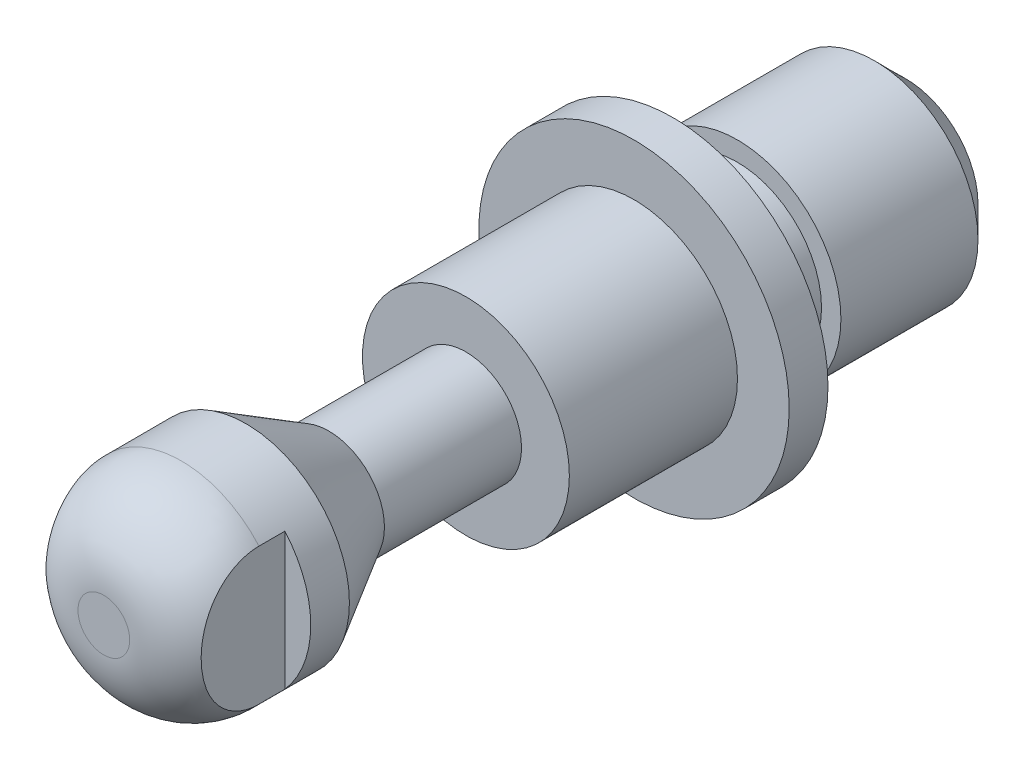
ISO-10303-21;
HEADER;
FILE_DESCRIPTION(('STEP AP214'),'2;1');
FILE_NAME('part.step','',(''),(''),'','','');
FILE_SCHEMA(('AUTOMOTIVE_DESIGN { 1 0 10303 214 1 1 1 1 }'));
ENDSEC;
DATA;
#1=APPLICATION_CONTEXT('core data for automotive mechanical design processes');
#2=APPLICATION_PROTOCOL_DEFINITION('international standard','automotive_design',2000,#1);
#3=PRODUCT_CONTEXT('',#1,'mechanical');
#4=PRODUCT('Part','Part','',(#3));
#5=PRODUCT_RELATED_PRODUCT_CATEGORY('part','',(#4));
#6=PRODUCT_DEFINITION_FORMATION('','',#4);
#7=PRODUCT_DEFINITION_CONTEXT('part definition',#1,'design');
#8=PRODUCT_DEFINITION('design','',#6,#7);
#9=PRODUCT_DEFINITION_SHAPE('','',#8);
#10=(LENGTH_UNIT() NAMED_UNIT(*) SI_UNIT(.MILLI.,.METRE.));
#11=(NAMED_UNIT(*) PLANE_ANGLE_UNIT() SI_UNIT($,.RADIAN.));
#12=(NAMED_UNIT(*) SI_UNIT($,.STERADIAN.) SOLID_ANGLE_UNIT());
#13=UNCERTAINTY_MEASURE_WITH_UNIT(LENGTH_MEASURE(1.E-05),#10,'distance_accuracy_value','');
#14=(GEOMETRIC_REPRESENTATION_CONTEXT(3) GLOBAL_UNCERTAINTY_ASSIGNED_CONTEXT((#13)) GLOBAL_UNIT_ASSIGNED_CONTEXT((#10,
#11,#12)) REPRESENTATION_CONTEXT('',''));
#15=CARTESIAN_POINT('',(0.,0.,0.));
#16=DIRECTION('',(0.,0.,1.));
#17=DIRECTION('',(1.,0.,0.));
#18=AXIS2_PLACEMENT_3D('',#15,#16,#17);
#19=CARTESIAN_POINT('',(0.,0.,0.));
#20=DIRECTION('',(0.,0.,-1.));
#21=DIRECTION('',(1.,0.,0.));
#22=AXIS2_PLACEMENT_3D('',#19,#20,#21);
#23=CYLINDRICAL_SURFACE('',#22,6.);
#24=CARTESIAN_POINT('',(0.,0.,0.));
#25=DIRECTION('',(0.,0.,-1.));
#26=DIRECTION('',(1.,0.,0.));
#27=AXIS2_PLACEMENT_3D('',#24,#25,#26);
#28=CIRCLE('',#27,6.);
#29=CARTESIAN_POINT('',(6.,0.,0.));
#30=VERTEX_POINT('',#29);
#31=EDGE_CURVE('E92',#30,#30,#28,.T.);
#32=ORIENTED_EDGE('',*,*,#31,.F.);
#33=EDGE_LOOP('',(#32));
#34=FACE_BOUND('',#33,.T.);
#35=CARTESIAN_POINT('',(0.,0.,1.5));
#36=DIRECTION('',(0.,0.,-1.));
#37=DIRECTION('',(1.,0.,0.));
#38=AXIS2_PLACEMENT_3D('',#35,#36,#37);
#39=CIRCLE('',#38,6.);
#40=CARTESIAN_POINT('',(6.,0.,1.5));
#41=VERTEX_POINT('',#40);
#42=EDGE_CURVE('E128',#41,#41,#39,.T.);
#43=ORIENTED_EDGE('',*,*,#42,.T.);
#44=EDGE_LOOP('',(#43));
#45=FACE_BOUND('',#44,.T.);
#46=ADVANCED_FACE('F15',(#34,#45),#23,.T.);
#47=CARTESIAN_POINT('',(0.,-6.,1.5));
#48=DIRECTION('',(0.,0.,-1.));
#49=DIRECTION('',(1.,0.,0.));
#50=AXIS2_PLACEMENT_3D('',#47,#48,#49);
#51=PLANE('',#50);
#52=ORIENTED_EDGE('',*,*,#42,.F.);
#53=EDGE_LOOP('',(#52));
#54=FACE_BOUND('',#53,.T.);
#55=CARTESIAN_POINT('',(0.,0.,1.5));
#56=DIRECTION('',(0.,0.,-1.));
#57=DIRECTION('',(1.,0.,0.));
#58=AXIS2_PLACEMENT_3D('',#55,#56,#57);
#59=CIRCLE('',#58,4.);
#60=CARTESIAN_POINT('',(4.,0.,1.5));
#61=VERTEX_POINT('',#60);
#62=EDGE_CURVE('E124',#61,#61,#59,.T.);
#63=ORIENTED_EDGE('',*,*,#62,.T.);
#64=EDGE_LOOP('',(#63));
#65=FACE_BOUND('',#64,.T.);
#66=ADVANCED_FACE('F181',(#54,#65),#51,.F.);
#67=CARTESIAN_POINT('',(0.,0.,0.));
#68=DIRECTION('',(0.,0.,-1.));
#69=DIRECTION('',(1.,0.,0.));
#70=AXIS2_PLACEMENT_3D('',#67,#68,#69);
#71=CYLINDRICAL_SURFACE('',#70,4.);
#72=ORIENTED_EDGE('',*,*,#62,.F.);
#73=EDGE_LOOP('',(#72));
#74=FACE_BOUND('',#73,.T.);
#75=CARTESIAN_POINT('',(0.,0.,8.));
#76=DIRECTION('',(0.,0.,-1.));
#77=DIRECTION('',(1.,0.,0.));
#78=AXIS2_PLACEMENT_3D('',#75,#76,#77);
#79=CIRCLE('',#78,4.);
#80=CARTESIAN_POINT('',(4.,0.,8.));
#81=VERTEX_POINT('',#80);
#82=EDGE_CURVE('E120',#81,#81,#79,.T.);
#83=ORIENTED_EDGE('',*,*,#82,.T.);
#84=EDGE_LOOP('',(#83));
#85=FACE_BOUND('',#84,.T.);
#86=ADVANCED_FACE('F187',(#74,#85),#71,.T.);
#87=CARTESIAN_POINT('',(0.,-2.15,8.));
#88=DIRECTION('',(0.,0.,-1.));
#89=DIRECTION('',(1.,0.,0.));
#90=AXIS2_PLACEMENT_3D('',#87,#88,#89);
#91=PLANE('',#90);
#92=ORIENTED_EDGE('',*,*,#82,.F.);
#93=EDGE_LOOP('',(#92));
#94=FACE_BOUND('',#93,.T.);
#95=CARTESIAN_POINT('',(0.,0.,8.));
#96=DIRECTION('',(0.,0.,-1.));
#97=DIRECTION('',(1.,0.,0.));
#98=AXIS2_PLACEMENT_3D('',#95,#96,#97);
#99=CIRCLE('',#98,2.15);
#100=CARTESIAN_POINT('',(2.15,0.,8.));
#101=VERTEX_POINT('',#100);
#102=EDGE_CURVE('E116',#101,#101,#99,.T.);
#103=ORIENTED_EDGE('',*,*,#102,.T.);
#104=EDGE_LOOP('',(#103));
#105=FACE_BOUND('',#104,.T.);
#106=ADVANCED_FACE('F195',(#94,#105),#91,.F.);
#107=CARTESIAN_POINT('',(0.,0.,0.));
#108=DIRECTION('',(0.,0.,-1.));
#109=DIRECTION('',(1.,0.,0.));
#110=AXIS2_PLACEMENT_3D('',#107,#108,#109);
#111=CYLINDRICAL_SURFACE('',#110,2.15);
#112=ORIENTED_EDGE('',*,*,#102,.F.);
#113=EDGE_LOOP('',(#112));
#114=FACE_BOUND('',#113,.T.);
#115=CARTESIAN_POINT('',(0.,0.,13.3));
#116=DIRECTION('',(0.,0.,-1.));
#117=DIRECTION('',(1.,0.,0.));
#118=AXIS2_PLACEMENT_3D('',#115,#116,#117);
#119=CIRCLE('',#118,2.15);
#120=CARTESIAN_POINT('',(2.15,0.,13.3));
#121=VERTEX_POINT('',#120);
#122=EDGE_CURVE('E112',#121,#121,#119,.T.);
#123=ORIENTED_EDGE('',*,*,#122,.T.);
#124=EDGE_LOOP('',(#123));
#125=FACE_BOUND('',#124,.T.);
#126=ADVANCED_FACE('F199',(#114,#125),#111,.T.);
#127=CARTESIAN_POINT('',(0.,0.,16.5042939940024));
#128=DIRECTION('',(0.,0.,1.));
#129=DIRECTION('',(-1.,0.,0.));
#130=AXIS2_PLACEMENT_3D('',#127,#128,#129);
#131=CONICAL_SURFACE('',#130,4.,0.523598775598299);
#132=ORIENTED_EDGE('',*,*,#122,.F.);
#133=EDGE_LOOP('',(#132));
#134=FACE_BOUND('',#133,.T.);
#135=CARTESIAN_POINT('',(0.,0.,16.5042939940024));
#136=DIRECTION('',(0.,0.,-1.));
#137=DIRECTION('',(1.,0.,0.));
#138=AXIS2_PLACEMENT_3D('',#135,#136,#137);
#139=CIRCLE('',#138,4.);
#140=CARTESIAN_POINT('',(4.,0.,16.5042939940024));
#141=VERTEX_POINT('',#140);
#142=EDGE_CURVE('E108',#141,#141,#139,.T.);
#143=ORIENTED_EDGE('',*,*,#142,.T.);
#144=EDGE_LOOP('',(#143));
#145=FACE_BOUND('',#144,.T.);
#146=ADVANCED_FACE('F203',(#134,#145),#131,.T.);
#147=CARTESIAN_POINT('',(0.,0.,0.));
#148=DIRECTION('',(0.,0.,-1.));
#149=DIRECTION('',(1.,0.,0.));
#150=AXIS2_PLACEMENT_3D('',#147,#148,#149);
#151=CYLINDRICAL_SURFACE('',#150,4.);
#152=CARTESIAN_POINT('',(0.,0.,19.));
#153=DIRECTION('',(0.,0.,-1.));
#154=DIRECTION('',(1.,0.,0.));
#155=AXIS2_PLACEMENT_3D('',#152,#153,#154);
#156=CIRCLE('',#155,4.);
#157=CARTESIAN_POINT('',(3.,-2.6457513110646,19.));
#158=VERTEX_POINT('',#157);
#159=CARTESIAN_POINT('',(-3.,-2.6457513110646,19.));
#160=VERTEX_POINT('',#159);
#161=EDGE_CURVE('E75',#158,#160,#156,.T.);
#162=ORIENTED_EDGE('',*,*,#161,.T.);
#163=DIRECTION('',(0.,0.,-1.));
#164=VECTOR('',#163,1.);
#165=CARTESIAN_POINT('',(-3.,-2.6457513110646,0.));
#166=LINE('',#165,#164);
#167=CARTESIAN_POINT('',(-3.,-2.6457513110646,18.));
#168=VERTEX_POINT('',#167);
#169=EDGE_CURVE('E31',#160,#168,#166,.T.);
#170=ORIENTED_EDGE('',*,*,#169,.T.);
#171=CARTESIAN_POINT('',(0.,0.,18.));
#172=DIRECTION('',(0.,0.,1.));
#173=DIRECTION('',(-1.,0.,0.));
#174=AXIS2_PLACEMENT_3D('',#171,#172,#173);
#175=CIRCLE('',#174,4.);
#176=CARTESIAN_POINT('',(-3.,2.6457513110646,18.));
#177=VERTEX_POINT('',#176);
#178=EDGE_CURVE('E60',#177,#168,#175,.T.);
#179=ORIENTED_EDGE('',*,*,#178,.F.);
#180=DIRECTION('',(0.,0.,-1.));
#181=VECTOR('',#180,1.);
#182=CARTESIAN_POINT('',(-3.,2.6457513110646,0.));
#183=LINE('',#182,#181);
#184=CARTESIAN_POINT('',(-3.,2.6457513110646,19.));
#185=VERTEX_POINT('',#184);
#186=EDGE_CURVE('E67',#177,#185,#183,.F.);
#187=ORIENTED_EDGE('',*,*,#186,.T.);
#188=CARTESIAN_POINT('',(3.,2.6457513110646,19.));
#189=VERTEX_POINT('',#188);
#190=EDGE_CURVE('E39',#185,#189,#156,.T.);
#191=ORIENTED_EDGE('',*,*,#190,.T.);
#192=DIRECTION('',(0.,0.,-1.));
#193=VECTOR('',#192,1.);
#194=CARTESIAN_POINT('',(3.,2.6457513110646,0.));
#195=LINE('',#194,#193);
#196=CARTESIAN_POINT('',(3.,2.6457513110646,18.));
#197=VERTEX_POINT('',#196);
#198=EDGE_CURVE('E89',#189,#197,#195,.T.);
#199=ORIENTED_EDGE('',*,*,#198,.T.);
#200=CARTESIAN_POINT('',(0.,0.,18.));
#201=DIRECTION('',(0.,0.,1.));
#202=DIRECTION('',(-1.,0.,0.));
#203=AXIS2_PLACEMENT_3D('',#200,#201,#202);
#204=CIRCLE('',#203,4.);
#205=CARTESIAN_POINT('',(3.,-2.6457513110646,18.));
#206=VERTEX_POINT('',#205);
#207=EDGE_CURVE('E146',#206,#197,#204,.T.);
#208=ORIENTED_EDGE('',*,*,#207,.F.);
#209=DIRECTION('',(0.,0.,-1.));
#210=VECTOR('',#209,1.);
#211=CARTESIAN_POINT('',(3.,-2.6457513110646,0.));
#212=LINE('',#211,#210);
#213=EDGE_CURVE('E83',#206,#158,#212,.F.);
#214=ORIENTED_EDGE('',*,*,#213,.T.);
#215=EDGE_LOOP('',(#162,#170,#179,#187,#191,#199,#208,#214));
#216=FACE_BOUND('',#215,.T.);
#217=ORIENTED_EDGE('',*,*,#142,.F.);
#218=EDGE_LOOP('',(#217));
#219=FACE_BOUND('',#218,.T.);
#220=ADVANCED_FACE('F71',(#216,#219),#151,.T.);
#221=CARTESIAN_POINT('',(0.,0.,22.));
#222=DIRECTION('',(0.,0.,-1.));
#223=DIRECTION('',(1.,0.,0.));
#224=AXIS2_PLACEMENT_3D('',#221,#222,#223);
#225=PLANE('',#224);
#226=CARTESIAN_POINT('',(0.,0.,22.));
#227=DIRECTION('',(0.,0.,-1.));
#228=DIRECTION('',(1.,0.,0.));
#229=AXIS2_PLACEMENT_3D('',#226,#227,#228);
#230=CIRCLE('',#229,1.);
#231=CARTESIAN_POINT('',(1.,0.,22.));
#232=VERTEX_POINT('',#231);
#233=EDGE_CURVE('E134',#232,#232,#230,.F.);
#234=ORIENTED_EDGE('',*,*,#233,.T.);
#235=EDGE_LOOP('',(#234));
#236=FACE_BOUND('',#235,.T.);
#237=ADVANCED_FACE('F210',(#236),#225,.F.);
#238=CARTESIAN_POINT('',(0.,-4.,-9.));
#239=DIRECTION('',(0.,0.,1.));
#240=DIRECTION('',(-1.,0.,0.));
#241=AXIS2_PLACEMENT_3D('',#238,#239,#240);
#242=PLANE('',#241);
#243=CARTESIAN_POINT('',(0.,0.,-9.));
#244=DIRECTION('',(0.,0.,1.));
#245=DIRECTION('',(1.,0.,0.));
#246=AXIS2_PLACEMENT_3D('',#243,#244,#245);
#247=CIRCLE('',#246,2.8);
#248=CARTESIAN_POINT('',(2.8,0.,-9.));
#249=VERTEX_POINT('',#248);
#250=EDGE_CURVE('E24',#249,#249,#247,.F.);
#251=ORIENTED_EDGE('',*,*,#250,.T.);
#252=EDGE_LOOP('',(#251));
#253=FACE_BOUND('',#252,.T.);
#254=ADVANCED_FACE('F171',(#253),#242,.F.);
#255=CARTESIAN_POINT('',(0.,0.,0.));
#256=DIRECTION('',(0.,0.,-1.));
#257=DIRECTION('',(1.,0.,0.));
#258=AXIS2_PLACEMENT_3D('',#255,#256,#257);
#259=CYLINDRICAL_SURFACE('',#258,4.);
#260=CARTESIAN_POINT('',(0.,0.,-7.8));
#261=DIRECTION('',(0.,0.,1.));
#262=DIRECTION('',(1.,0.,0.));
#263=AXIS2_PLACEMENT_3D('',#260,#261,#262);
#264=CIRCLE('',#263,4.);
#265=CARTESIAN_POINT('',(4.,0.,-7.8));
#266=VERTEX_POINT('',#265);
#267=EDGE_CURVE('E9',#266,#266,#264,.T.);
#268=ORIENTED_EDGE('',*,*,#267,.T.);
#269=EDGE_LOOP('',(#268));
#270=FACE_BOUND('',#269,.T.);
#271=CARTESIAN_POINT('',(0.,0.,-2.5));
#272=DIRECTION('',(0.,0.,-1.));
#273=DIRECTION('',(1.,0.,0.));
#274=AXIS2_PLACEMENT_3D('',#271,#272,#273);
#275=CIRCLE('',#274,4.);
#276=CARTESIAN_POINT('',(4.,0.,-2.5));
#277=VERTEX_POINT('',#276);
#278=EDGE_CURVE('E104',#277,#277,#275,.T.);
#279=ORIENTED_EDGE('',*,*,#278,.T.);
#280=EDGE_LOOP('',(#279));
#281=FACE_BOUND('',#280,.T.);
#282=ADVANCED_FACE('F216',(#270,#281),#259,.T.);
#283=CARTESIAN_POINT('',(0.,-3.25,-2.5));
#284=DIRECTION('',(0.,0.,-1.));
#285=DIRECTION('',(1.,0.,0.));
#286=AXIS2_PLACEMENT_3D('',#283,#284,#285);
#287=PLANE('',#286);
#288=ORIENTED_EDGE('',*,*,#278,.F.);
#289=EDGE_LOOP('',(#288));
#290=FACE_BOUND('',#289,.T.);
#291=CARTESIAN_POINT('',(0.,0.,-2.5));
#292=DIRECTION('',(0.,0.,-1.));
#293=DIRECTION('',(1.,0.,0.));
#294=AXIS2_PLACEMENT_3D('',#291,#292,#293);
#295=CIRCLE('',#294,3.25);
#296=CARTESIAN_POINT('',(3.25,0.,-2.5));
#297=VERTEX_POINT('',#296);
#298=EDGE_CURVE('E100',#297,#297,#295,.T.);
#299=ORIENTED_EDGE('',*,*,#298,.T.);
#300=EDGE_LOOP('',(#299));
#301=FACE_BOUND('',#300,.T.);
#302=ADVANCED_FACE('F219',(#290,#301),#287,.F.);
#303=CARTESIAN_POINT('',(0.,0.,0.));
#304=DIRECTION('',(0.,0.,-1.));
#305=DIRECTION('',(1.,0.,0.));
#306=AXIS2_PLACEMENT_3D('',#303,#304,#305);
#307=CYLINDRICAL_SURFACE('',#306,3.25);
#308=ORIENTED_EDGE('',*,*,#298,.F.);
#309=EDGE_LOOP('',(#308));
#310=FACE_BOUND('',#309,.T.);
#311=CARTESIAN_POINT('',(0.,0.,0.));
#312=DIRECTION('',(0.,0.,-1.));
#313=DIRECTION('',(1.,0.,0.));
#314=AXIS2_PLACEMENT_3D('',#311,#312,#313);
#315=CIRCLE('',#314,3.25);
#316=CARTESIAN_POINT('',(3.25,0.,0.));
#317=VERTEX_POINT('',#316);
#318=EDGE_CURVE('E96',#317,#317,#315,.T.);
#319=ORIENTED_EDGE('',*,*,#318,.T.);
#320=EDGE_LOOP('',(#319));
#321=FACE_BOUND('',#320,.T.);
#322=ADVANCED_FACE('F223',(#310,#321),#307,.T.);
#323=CARTESIAN_POINT('',(0.,-3.25,0.));
#324=DIRECTION('',(0.,0.,1.));
#325=DIRECTION('',(-1.,0.,0.));
#326=AXIS2_PLACEMENT_3D('',#323,#324,#325);
#327=PLANE('',#326);
#328=ORIENTED_EDGE('',*,*,#318,.F.);
#329=EDGE_LOOP('',(#328));
#330=FACE_BOUND('',#329,.T.);
#331=ORIENTED_EDGE('',*,*,#31,.T.);
#332=EDGE_LOOP('',(#331));
#333=FACE_BOUND('',#332,.T.);
#334=ADVANCED_FACE('F226',(#330,#333),#327,.F.);
#335=CARTESIAN_POINT('',(0.,0.,19.));
#336=DIRECTION('',(0.,0.,-1.));
#337=DIRECTION('',(1.,0.,0.));
#338=AXIS2_PLACEMENT_3D('',#335,#336,#337);
#339=DEGENERATE_TOROIDAL_SURFACE('',#338,1.,3.,.T.);
#340=CARTESIAN_POINT('',(-3.,0.,21.2360679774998));
#341=CARTESIAN_POINT('',(-3.,0.18213042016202,21.2360730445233));
#342=CARTESIAN_POINT('',(-3.,0.36431584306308,21.2213187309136));
#343=CARTESIAN_POINT('',(-3.,0.723592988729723,21.1613493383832));
#344=CARTESIAN_POINT('',(-3.,0.900689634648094,21.1161648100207));
#345=CARTESIAN_POINT('',(-3.,1.20801765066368,21.0061514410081));
#346=CARTESIAN_POINT('',(-3.,1.3403812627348,20.9472966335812));
#347=CARTESIAN_POINT('',(-3.,1.59371415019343,20.8086382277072));
#348=CARTESIAN_POINT('',(-3.,1.71469026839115,20.7288473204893));
#349=CARTESIAN_POINT('',(-3.,1.94131475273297,20.548058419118));
#350=CARTESIAN_POINT('',(-3.,2.04683753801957,20.4469014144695));
#351=CARTESIAN_POINT('',(-3.,2.23610882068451,20.2258543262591));
#352=CARTESIAN_POINT('',(-3.,2.31987165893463,20.1059766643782));
#353=CARTESIAN_POINT('',(-3.,2.45137620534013,19.8685696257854));
#354=CARTESIAN_POINT('',(-3.,2.50243931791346,19.7528750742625));
#355=CARTESIAN_POINT('',(-3.,2.58222641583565,19.5140328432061));
#356=CARTESIAN_POINT('',(-3.,2.61096503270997,19.3908901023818));
#357=CARTESIAN_POINT('',(-3.,2.64317885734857,19.1526642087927));
#358=CARTESIAN_POINT('',(-3.,2.64869439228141,19.0378527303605));
#359=CARTESIAN_POINT('',(-3.,2.63985285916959,18.8090131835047));
#360=CARTESIAN_POINT('',(-3.,2.62550060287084,18.6949849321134));
#361=CARTESIAN_POINT('',(-3.,2.57811323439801,18.4737675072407));
#362=CARTESIAN_POINT('',(-3.,2.54553396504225,18.366479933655));
#363=CARTESIAN_POINT('',(-3.,2.46330877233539,18.1586814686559));
#364=CARTESIAN_POINT('',(-3.,2.41366206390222,18.0581708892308));
#365=CARTESIAN_POINT('',(-3.,2.29748673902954,17.8635303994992));
#366=CARTESIAN_POINT('',(-3.,2.23051545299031,17.769665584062));
#367=CARTESIAN_POINT('',(-3.,2.08284770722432,17.5934794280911));
#368=CARTESIAN_POINT('',(-3.,2.00214781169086,17.5111609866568));
#369=CARTESIAN_POINT('',(-3.,1.8226461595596,17.3531312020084));
#370=CARTESIAN_POINT('',(-3.,1.72291044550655,17.2784840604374));
#371=CARTESIAN_POINT('',(-3.,1.51360451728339,17.1446444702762));
#372=CARTESIAN_POINT('',(-3.,1.40403016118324,17.0854585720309));
#373=CARTESIAN_POINT('',(-3.,1.16220414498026,16.9752876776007));
#374=CARTESIAN_POINT('',(-3.,1.0289168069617,16.9265841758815));
#375=CARTESIAN_POINT('',(-3.,0.756854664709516,16.8483168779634));
#376=CARTESIAN_POINT('',(-3.,0.618076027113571,16.8187667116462));
#377=CARTESIAN_POINT('',(-3.,0.311732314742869,16.7741468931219));
#378=CARTESIAN_POINT('',(-3.,0.143620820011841,16.7628003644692));
#379=CARTESIAN_POINT('',(-3.,-0.192610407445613,16.7652425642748));
#380=CARTESIAN_POINT('',(-3.,-0.360729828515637,16.7790661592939));
#381=CARTESIAN_POINT('',(-3.,-0.711775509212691,16.8356870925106));
#382=CARTESIAN_POINT('',(-3.,-0.894221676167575,16.8815892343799));
#383=CARTESIAN_POINT('',(-3.,-1.24678385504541,17.0076571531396));
#384=CARTESIAN_POINT('',(-3.,-1.41692949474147,17.0877371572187));
#385=CARTESIAN_POINT('',(-3.,-1.68782709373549,17.253590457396));
#386=CARTESIAN_POINT('',(-3.,-1.79407437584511,17.3304326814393));
#387=CARTESIAN_POINT('',(-3.,-1.99244199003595,17.5006681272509));
#388=CARTESIAN_POINT('',(-3.,-2.08456939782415,17.5940530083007));
#389=CARTESIAN_POINT('',(-3.,-2.25136410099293,17.796238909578));
#390=CARTESIAN_POINT('',(-3.,-2.32593419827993,17.9051206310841));
#391=CARTESIAN_POINT('',(-3.,-2.45340856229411,18.1349484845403));
#392=CARTESIAN_POINT('',(-3.,-2.50632050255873,18.2558903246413));
#393=CARTESIAN_POINT('',(-3.,-2.58380733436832,18.4936035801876));
#394=CARTESIAN_POINT('',(-3.,-2.61062950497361,18.6096453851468));
#395=CARTESIAN_POINT('',(-3.,-2.64319909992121,18.8446356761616));
#396=CARTESIAN_POINT('',(-3.,-2.648955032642,18.9635829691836));
#397=CARTESIAN_POINT('',(-3.,-2.6394119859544,19.1942716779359));
#398=CARTESIAN_POINT('',(-3.,-2.6252141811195,19.3060605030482));
#399=CARTESIAN_POINT('',(-3.,-2.57829739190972,19.525661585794));
#400=CARTESIAN_POINT('',(-3.,-2.54557999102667,19.63347418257));
#401=CARTESIAN_POINT('',(-3.,-2.46277618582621,19.8425934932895));
#402=CARTESIAN_POINT('',(-3.,-2.41263246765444,19.9438774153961));
#403=CARTESIAN_POINT('',(-3.,-2.29688023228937,20.1371530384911));
#404=CARTESIAN_POINT('',(-3.,-2.23126933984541,20.229143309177));
#405=CARTESIAN_POINT('',(-3.,-2.08293087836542,20.4067191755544));
#406=CARTESIAN_POINT('',(-3.,-1.99947023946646,20.4916905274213));
#407=CARTESIAN_POINT('',(-3.,-1.82071046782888,20.6480453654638));
#408=CARTESIAN_POINT('',(-3.,-1.72540724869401,20.7194241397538));
#409=CARTESIAN_POINT('',(-3.,-1.51485660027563,20.8550675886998));
#410=CARTESIAN_POINT('',(-3.,-1.39856751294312,20.9177097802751));
#411=CARTESIAN_POINT('',(-3.,-1.15828317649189,21.0257432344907));
#412=CARTESIAN_POINT('',(-3.,-1.03428427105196,21.0711262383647));
#413=CARTESIAN_POINT('',(-3.,-0.760833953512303,21.1513162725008));
#414=CARTESIAN_POINT('',(-3.,-0.610526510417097,21.1831966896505));
#415=CARTESIAN_POINT('',(-3.,-0.306828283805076,21.2255846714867));
#416=CARTESIAN_POINT('',(-3.,-0.153433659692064,21.2360637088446));
#417=CARTESIAN_POINT('',(-3.,0.,21.2360679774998));
#418=B_SPLINE_CURVE_WITH_KNOTS('',3,(#340,#341,#342,#343,#344,#345,#346,#347,#348,#349,#350,
#351,#352,#353,#354,#355,#356,#357,#358,#359,#360,#361,#362,#363,#364,#365,#366,#367,#368,#369,
#370,#371,#372,#373,#374,#375,#376,#377,#378,#379,#380,#381,#382,#383,#384,#385,#386,#387,#388,
#389,#390,#391,#392,#393,#394,#395,#396,#397,#398,#399,#400,#401,#402,#403,#404,#405,#406,#407,
#408,#409,#410,#411,#412,#413,#414,#415,#416,#417),.UNSPECIFIED.,.T.,.F.,(4,2,2,2,2,2,2,2,2,2,2,
2,2,2,2,2,2,2,2,2,2,2,2,2,2,2,2,2,2,2,2,2,2,2,2,2,2,2,4),(0.,0.545881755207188,1.09121628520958,
1.52407148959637,1.95666490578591,2.39259896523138,2.82824498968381,3.20555876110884,
3.58262503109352,3.92576653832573,4.26882495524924,4.60366436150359,4.93851917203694,
5.28296170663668,5.62749057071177,5.99973468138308,6.37213624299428,6.79627198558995,
7.2207092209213,7.72421554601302,8.22841987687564,8.78974139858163,9.34966243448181,
9.74144173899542,10.1330240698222,10.5267257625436,10.9202878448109,11.2757520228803,
11.6310726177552,11.9675363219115,12.3039712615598,12.6415233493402,12.9791273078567,
13.3349649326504,13.6909256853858,14.0856703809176,14.4806037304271,14.9398637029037,
15.3997354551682),.UNSPECIFIED.);
#419=EDGE_CURVE('E64',#160,#185,#418,.T.);
#420=ORIENTED_EDGE('',*,*,#419,.F.);
#421=ORIENTED_EDGE('',*,*,#161,.F.);
#422=CARTESIAN_POINT('',(3.,0.,21.2360679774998));
#423=CARTESIAN_POINT('',(3.,-0.18213042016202,21.2360730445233));
#424=CARTESIAN_POINT('',(3.,-0.36431584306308,21.2213187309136));
#425=CARTESIAN_POINT('',(3.,-0.723592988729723,21.1613493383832));
#426=CARTESIAN_POINT('',(3.,-0.900689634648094,21.1161648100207));
#427=CARTESIAN_POINT('',(3.,-1.20801765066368,21.0061514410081));
#428=CARTESIAN_POINT('',(3.,-1.3403812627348,20.9472966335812));
#429=CARTESIAN_POINT('',(3.,-1.59371415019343,20.8086382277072));
#430=CARTESIAN_POINT('',(3.,-1.71469026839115,20.7288473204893));
#431=CARTESIAN_POINT('',(3.,-1.94131475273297,20.548058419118));
#432=CARTESIAN_POINT('',(3.,-2.04683753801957,20.4469014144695));
#433=CARTESIAN_POINT('',(3.,-2.23610882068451,20.2258543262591));
#434=CARTESIAN_POINT('',(3.,-2.31987165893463,20.1059766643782));
#435=CARTESIAN_POINT('',(3.,-2.45137620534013,19.8685696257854));
#436=CARTESIAN_POINT('',(3.,-2.50243931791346,19.7528750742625));
#437=CARTESIAN_POINT('',(3.,-2.58222641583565,19.5140328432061));
#438=CARTESIAN_POINT('',(3.,-2.61096503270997,19.3908901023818));
#439=CARTESIAN_POINT('',(3.,-2.64317885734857,19.1526642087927));
#440=CARTESIAN_POINT('',(3.,-2.64869439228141,19.0378527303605));
#441=CARTESIAN_POINT('',(3.,-2.6398528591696,18.8090131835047));
#442=CARTESIAN_POINT('',(3.,-2.62550060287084,18.6949849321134));
#443=CARTESIAN_POINT('',(3.,-2.57811323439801,18.4737675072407));
#444=CARTESIAN_POINT('',(3.,-2.54553396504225,18.366479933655));
#445=CARTESIAN_POINT('',(3.,-2.46330877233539,18.1586814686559));
#446=CARTESIAN_POINT('',(3.,-2.41366206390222,18.0581708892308));
#447=CARTESIAN_POINT('',(3.,-2.29748673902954,17.8635303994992));
#448=CARTESIAN_POINT('',(3.,-2.23051545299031,17.769665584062));
#449=CARTESIAN_POINT('',(3.,-2.08284770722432,17.5934794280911));
#450=CARTESIAN_POINT('',(3.,-2.00214781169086,17.5111609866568));
#451=CARTESIAN_POINT('',(3.,-1.8226461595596,17.3531312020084));
#452=CARTESIAN_POINT('',(3.,-1.72291044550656,17.2784840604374));
#453=CARTESIAN_POINT('',(3.,-1.5136045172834,17.1446444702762));
#454=CARTESIAN_POINT('',(3.,-1.40403016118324,17.0854585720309));
#455=CARTESIAN_POINT('',(3.,-1.16220414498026,16.9752876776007));
#456=CARTESIAN_POINT('',(3.,-1.0289168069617,16.9265841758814));
#457=CARTESIAN_POINT('',(3.,-0.756854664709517,16.8483168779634));
#458=CARTESIAN_POINT('',(3.,-0.618076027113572,16.8187667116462));
#459=CARTESIAN_POINT('',(3.,-0.311732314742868,16.7741468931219));
#460=CARTESIAN_POINT('',(3.,-0.143620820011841,16.7628003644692));
#461=CARTESIAN_POINT('',(3.,0.192610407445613,16.7652425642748));
#462=CARTESIAN_POINT('',(3.,0.360729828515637,16.7790661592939));
#463=CARTESIAN_POINT('',(3.,0.711775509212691,16.8356870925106));
#464=CARTESIAN_POINT('',(3.,0.894221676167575,16.8815892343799));
#465=CARTESIAN_POINT('',(3.,1.24678385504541,17.0076571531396));
#466=CARTESIAN_POINT('',(3.,1.41692949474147,17.0877371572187));
#467=CARTESIAN_POINT('',(3.,1.68782709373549,17.253590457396));
#468=CARTESIAN_POINT('',(3.,1.79407437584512,17.3304326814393));
#469=CARTESIAN_POINT('',(3.,1.99244199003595,17.5006681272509));
#470=CARTESIAN_POINT('',(3.,2.08456939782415,17.5940530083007));
#471=CARTESIAN_POINT('',(3.,2.25136410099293,17.796238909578));
#472=CARTESIAN_POINT('',(3.,2.32593419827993,17.9051206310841));
#473=CARTESIAN_POINT('',(3.,2.45340856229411,18.1349484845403));
#474=CARTESIAN_POINT('',(3.,2.50632050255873,18.2558903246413));
#475=CARTESIAN_POINT('',(3.,2.58380733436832,18.4936035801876));
#476=CARTESIAN_POINT('',(3.,2.61062950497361,18.6096453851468));
#477=CARTESIAN_POINT('',(3.,2.64319909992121,18.8446356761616));
#478=CARTESIAN_POINT('',(3.,2.648955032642,18.9635829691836));
#479=CARTESIAN_POINT('',(3.,2.6394119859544,19.1942716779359));
#480=CARTESIAN_POINT('',(3.,2.6252141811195,19.3060605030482));
#481=CARTESIAN_POINT('',(3.,2.57829739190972,19.525661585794));
#482=CARTESIAN_POINT('',(3.,2.54557999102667,19.63347418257));
#483=CARTESIAN_POINT('',(3.,2.46277618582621,19.8425934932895));
#484=CARTESIAN_POINT('',(3.,2.41263246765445,19.9438774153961));
#485=CARTESIAN_POINT('',(3.,2.29688023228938,20.1371530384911));
#486=CARTESIAN_POINT('',(3.,2.23126933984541,20.229143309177));
#487=CARTESIAN_POINT('',(3.,2.08293087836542,20.4067191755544));
#488=CARTESIAN_POINT('',(3.,1.99947023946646,20.4916905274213));
#489=CARTESIAN_POINT('',(3.,1.82071046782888,20.6480453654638));
#490=CARTESIAN_POINT('',(3.,1.72540724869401,20.7194241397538));
#491=CARTESIAN_POINT('',(3.,1.51485660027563,20.8550675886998));
#492=CARTESIAN_POINT('',(3.,1.39856751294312,20.9177097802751));
#493=CARTESIAN_POINT('',(3.,1.15828317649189,21.0257432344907));
#494=CARTESIAN_POINT('',(3.,1.03428427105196,21.0711262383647));
#495=CARTESIAN_POINT('',(3.,0.760833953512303,21.1513162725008));
#496=CARTESIAN_POINT('',(3.,0.610526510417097,21.1831966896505));
#497=CARTESIAN_POINT('',(3.,0.306828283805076,21.2255846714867));
#498=CARTESIAN_POINT('',(3.,0.153433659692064,21.2360637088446));
#499=CARTESIAN_POINT('',(3.,0.,21.2360679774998));
#500=B_SPLINE_CURVE_WITH_KNOTS('',3,(#422,#423,#424,#425,#426,#427,#428,#429,#430,#431,#432,
#433,#434,#435,#436,#437,#438,#439,#440,#441,#442,#443,#444,#445,#446,#447,#448,#449,#450,#451,
#452,#453,#454,#455,#456,#457,#458,#459,#460,#461,#462,#463,#464,#465,#466,#467,#468,#469,#470,
#471,#472,#473,#474,#475,#476,#477,#478,#479,#480,#481,#482,#483,#484,#485,#486,#487,#488,#489,
#490,#491,#492,#493,#494,#495,#496,#497,#498,#499),.UNSPECIFIED.,.T.,.F.,(4,2,2,2,2,2,2,2,2,2,2,
2,2,2,2,2,2,2,2,2,2,2,2,2,2,2,2,2,2,2,2,2,2,2,2,2,2,2,4),(0.,0.545881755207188,1.09121628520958,
1.52407148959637,1.95666490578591,2.39259896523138,2.82824498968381,3.20555876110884,
3.58262503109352,3.92576653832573,4.26882495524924,4.60366436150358,4.93851917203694,
5.28296170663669,5.62749057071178,5.99973468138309,6.37213624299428,6.79627198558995,
7.2207092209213,7.72421554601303,8.22841987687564,8.78974139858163,9.34966243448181,
9.74144173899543,10.1330240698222,10.5267257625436,10.9202878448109,11.2757520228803,
11.6310726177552,11.9675363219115,12.3039712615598,12.6415233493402,12.9791273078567,
13.3349649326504,13.6909256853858,14.0856703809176,14.4806037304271,14.9398637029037,
15.3997354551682),.UNSPECIFIED.);
#501=EDGE_CURVE('E138',#189,#158,#500,.T.);
#502=ORIENTED_EDGE('',*,*,#501,.F.);
#503=ORIENTED_EDGE('',*,*,#190,.F.);
#504=EDGE_LOOP('',(#420,#421,#502,#503));
#505=FACE_BOUND('',#504,.T.);
#506=ORIENTED_EDGE('',*,*,#233,.F.);
#507=EDGE_LOOP('',(#506));
#508=FACE_BOUND('',#507,.T.);
#509=ADVANCED_FACE('F148',(#505,#508),#339,.T.);
#510=CARTESIAN_POINT('',(3.,5.,18.));
#511=DIRECTION('',(0.,0.,1.));
#512=DIRECTION('',(-1.,0.,0.));
#513=AXIS2_PLACEMENT_3D('',#510,#511,#512);
#514=PLANE('',#513);
#515=ORIENTED_EDGE('',*,*,#207,.T.);
#516=DIRECTION('',(0.,-1.,0.));
#517=VECTOR('',#516,1.);
#518=CARTESIAN_POINT('',(3.,5.,18.));
#519=LINE('',#518,#517);
#520=EDGE_CURVE('E77',#197,#206,#519,.T.);
#521=ORIENTED_EDGE('',*,*,#520,.T.);
#522=EDGE_LOOP('',(#515,#521));
#523=FACE_BOUND('',#522,.T.);
#524=ADVANCED_FACE('F155',(#523),#514,.T.);
#525=CARTESIAN_POINT('',(3.,5.,18.));
#526=DIRECTION('',(-1.,0.,0.));
#527=DIRECTION('',(0.,1.,0.));
#528=AXIS2_PLACEMENT_3D('',#525,#526,#527);
#529=PLANE('',#528);
#530=ORIENTED_EDGE('',*,*,#501,.T.);
#531=ORIENTED_EDGE('',*,*,#213,.F.);
#532=ORIENTED_EDGE('',*,*,#520,.F.);
#533=ORIENTED_EDGE('',*,*,#198,.F.);
#534=EDGE_LOOP('',(#530,#531,#532,#533));
#535=FACE_BOUND('',#534,.T.);
#536=ADVANCED_FACE('F151',(#535),#529,.F.);
#537=CARTESIAN_POINT('',(-5.5,-5.,18.));
#538=DIRECTION('',(0.,0.,1.));
#539=DIRECTION('',(-1.,0.,0.));
#540=AXIS2_PLACEMENT_3D('',#537,#538,#539);
#541=PLANE('',#540);
#542=ORIENTED_EDGE('',*,*,#178,.T.);
#543=DIRECTION('',(0.,1.,0.));
#544=VECTOR('',#543,1.);
#545=CARTESIAN_POINT('',(-3.,5.,18.));
#546=LINE('',#545,#544);
#547=EDGE_CURVE('E62',#168,#177,#546,.T.);
#548=ORIENTED_EDGE('',*,*,#547,.T.);
#549=EDGE_LOOP('',(#542,#548));
#550=FACE_BOUND('',#549,.T.);
#551=ADVANCED_FACE('F61',(#550),#541,.T.);
#552=CARTESIAN_POINT('',(-3.,5.,18.));
#553=DIRECTION('',(1.,0.,0.));
#554=DIRECTION('',(0.,-1.,0.));
#555=AXIS2_PLACEMENT_3D('',#552,#553,#554);
#556=PLANE('',#555);
#557=ORIENTED_EDGE('',*,*,#419,.T.);
#558=ORIENTED_EDGE('',*,*,#186,.F.);
#559=ORIENTED_EDGE('',*,*,#547,.F.);
#560=ORIENTED_EDGE('',*,*,#169,.F.);
#561=EDGE_LOOP('',(#557,#558,#559,#560));
#562=FACE_BOUND('',#561,.T.);
#563=ADVANCED_FACE('F66',(#562),#556,.F.);
#564=CARTESIAN_POINT('',(0.,0.,-9.));
#565=DIRECTION('',(0.,0.,1.));
#566=DIRECTION('',(1.,0.,0.));
#567=AXIS2_PLACEMENT_3D('',#564,#565,#566);
#568=CONICAL_SURFACE('',#567,2.8,0.785398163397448);
#569=ORIENTED_EDGE('',*,*,#267,.F.);
#570=EDGE_LOOP('',(#569));
#571=FACE_BOUND('',#570,.T.);
#572=ORIENTED_EDGE('',*,*,#250,.F.);
#573=EDGE_LOOP('',(#572));
#574=FACE_BOUND('',#573,.T.);
#575=ADVANCED_FACE('F17',(#571,#574),#568,.T.);
#576=CLOSED_SHELL('',(#46,#66,#86,#106,#126,#146,#220,#237,#254,#282,#302,#322,#334,#509,#524,
#536,#551,#563,#575));
#577=MANIFOLD_SOLID_BREP('B1',#576);
#578=ADVANCED_BREP_SHAPE_REPRESENTATION('',(#18,#577),#14);
#579=SHAPE_DEFINITION_REPRESENTATION(#9,#578);
ENDSEC;
END-ISO-10303-21;
